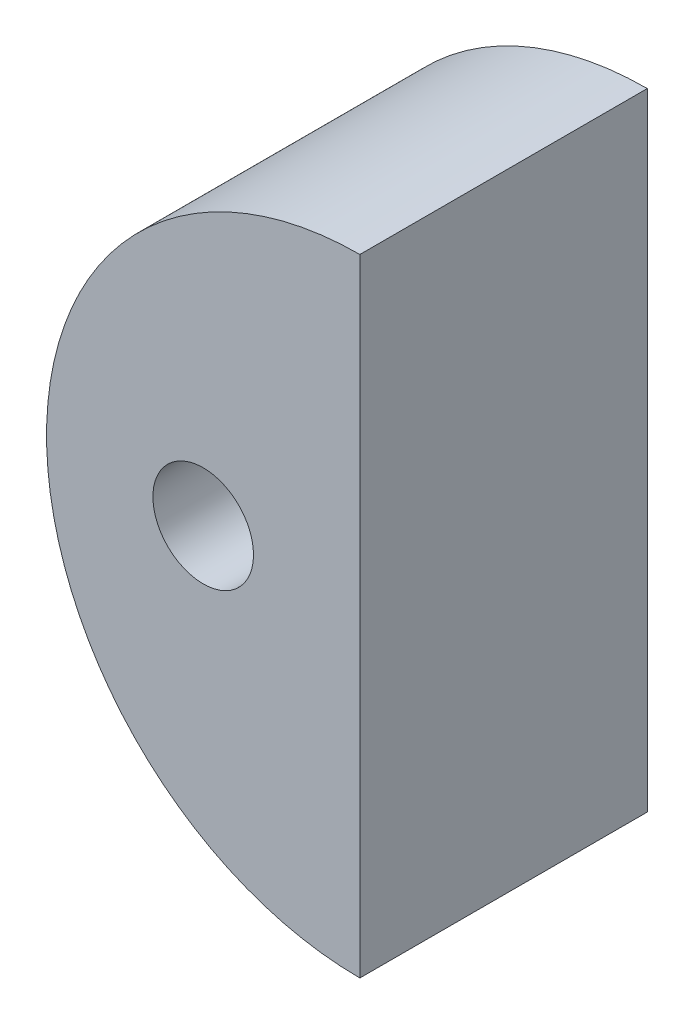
ISO-10303-21;
HEADER;
FILE_DESCRIPTION(('STEP AP214'),'2;1');
FILE_NAME('part.step','',(''),(''),'','','');
FILE_SCHEMA(('AUTOMOTIVE_DESIGN { 1 0 10303 214 1 1 1 1 }'));
ENDSEC;
DATA;
#1=APPLICATION_CONTEXT('core data for automotive mechanical design processes');
#2=APPLICATION_PROTOCOL_DEFINITION('international standard','automotive_design',2000,#1);
#3=PRODUCT_CONTEXT('',#1,'mechanical');
#4=PRODUCT('Part','Part','',(#3));
#5=PRODUCT_RELATED_PRODUCT_CATEGORY('part','',(#4));
#6=PRODUCT_DEFINITION_FORMATION('','',#4);
#7=PRODUCT_DEFINITION_CONTEXT('part definition',#1,'design');
#8=PRODUCT_DEFINITION('design','',#6,#7);
#9=PRODUCT_DEFINITION_SHAPE('','',#8);
#10=(LENGTH_UNIT() NAMED_UNIT(*) SI_UNIT(.MILLI.,.METRE.));
#11=(NAMED_UNIT(*) PLANE_ANGLE_UNIT() SI_UNIT($,.RADIAN.));
#12=(NAMED_UNIT(*) SI_UNIT($,.STERADIAN.) SOLID_ANGLE_UNIT());
#13=UNCERTAINTY_MEASURE_WITH_UNIT(LENGTH_MEASURE(1.E-05),#10,'distance_accuracy_value','');
#14=(GEOMETRIC_REPRESENTATION_CONTEXT(3) GLOBAL_UNCERTAINTY_ASSIGNED_CONTEXT((#13)) GLOBAL_UNIT_ASSIGNED_CONTEXT((#10,
#11,#12)) REPRESENTATION_CONTEXT('',''));
#15=CARTESIAN_POINT('',(0.,0.,0.));
#16=DIRECTION('',(0.,0.,1.));
#17=DIRECTION('',(1.,0.,0.));
#18=AXIS2_PLACEMENT_3D('',#15,#16,#17);
#19=CARTESIAN_POINT('',(-30.,-4.60000000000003,10.));
#20=DIRECTION('',(0.,0.,1.));
#21=DIRECTION('',(1.,0.,0.));
#22=AXIS2_PLACEMENT_3D('',#19,#20,#21);
#23=PLANE('',#22);
#24=CARTESIAN_POINT('',(-30.,-4.60000000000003,10.));
#25=DIRECTION('',(0.,0.,1.));
#26=DIRECTION('',(1.,0.,0.));
#27=AXIS2_PLACEMENT_3D('',#24,#25,#26);
#28=CIRCLE('',#27,10.9);
#29=CARTESIAN_POINT('',(-30.,6.29999999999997,10.));
#30=VERTEX_POINT('',#29);
#31=CARTESIAN_POINT('',(-30.,-15.5,10.));
#32=VERTEX_POINT('',#31);
#33=EDGE_CURVE('E70',#30,#32,#28,.T.);
#34=ORIENTED_EDGE('',*,*,#33,.T.);
#35=DIRECTION('',(0.,1.,0.));
#36=VECTOR('',#35,1.);
#37=CARTESIAN_POINT('',(-30.,6.29999999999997,10.));
#38=LINE('',#37,#36);
#39=EDGE_CURVE('E55',#32,#30,#38,.T.);
#40=ORIENTED_EDGE('',*,*,#39,.T.);
#41=EDGE_LOOP('',(#34,#40));
#42=FACE_BOUND('',#41,.T.);
#43=CARTESIAN_POINT('',(-35.45,-4.60000000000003,10.));
#44=DIRECTION('',(0.,0.,1.));
#45=DIRECTION('',(1.,0.,0.));
#46=AXIS2_PLACEMENT_3D('',#43,#44,#45);
#47=CIRCLE('',#46,1.75);
#48=CARTESIAN_POINT('',(-33.7,-4.60000000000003,10.));
#49=VERTEX_POINT('',#48);
#50=EDGE_CURVE('E76',#49,#49,#47,.T.);
#51=ORIENTED_EDGE('',*,*,#50,.F.);
#52=EDGE_LOOP('',(#51));
#53=FACE_BOUND('',#52,.T.);
#54=ADVANCED_FACE('F39',(#42,#53),#23,.T.);
#55=CARTESIAN_POINT('',(-30.,-4.60000000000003,0.));
#56=DIRECTION('',(0.,0.,1.));
#57=DIRECTION('',(1.,0.,0.));
#58=AXIS2_PLACEMENT_3D('',#55,#56,#57);
#59=PLANE('',#58);
#60=CARTESIAN_POINT('',(-30.,-4.60000000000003,0.));
#61=DIRECTION('',(0.,0.,1.));
#62=DIRECTION('',(1.,0.,0.));
#63=AXIS2_PLACEMENT_3D('',#60,#61,#62);
#64=CIRCLE('',#63,10.9);
#65=CARTESIAN_POINT('',(-30.,6.29999999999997,0.));
#66=VERTEX_POINT('',#65);
#67=CARTESIAN_POINT('',(-30.,-15.5,0.));
#68=VERTEX_POINT('',#67);
#69=EDGE_CURVE('E71',#66,#68,#64,.T.);
#70=ORIENTED_EDGE('',*,*,#69,.F.);
#71=DIRECTION('',(0.,1.,0.));
#72=VECTOR('',#71,1.);
#73=CARTESIAN_POINT('',(-30.,6.29999999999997,0.));
#74=LINE('',#73,#72);
#75=EDGE_CURVE('E63',#68,#66,#74,.T.);
#76=ORIENTED_EDGE('',*,*,#75,.F.);
#77=EDGE_LOOP('',(#70,#76));
#78=FACE_BOUND('',#77,.T.);
#79=CARTESIAN_POINT('',(-35.45,-4.60000000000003,0.));
#80=DIRECTION('',(0.,0.,1.));
#81=DIRECTION('',(1.,0.,0.));
#82=AXIS2_PLACEMENT_3D('',#79,#80,#81);
#83=CIRCLE('',#82,1.75);
#84=CARTESIAN_POINT('',(-33.7,-4.60000000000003,0.));
#85=VERTEX_POINT('',#84);
#86=EDGE_CURVE('E79',#85,#85,#83,.T.);
#87=ORIENTED_EDGE('',*,*,#86,.T.);
#88=EDGE_LOOP('',(#87));
#89=FACE_BOUND('',#88,.T.);
#90=ADVANCED_FACE('F74',(#78,#89),#59,.F.);
#91=CARTESIAN_POINT('',(-30.,-4.60000000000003,10.));
#92=DIRECTION('',(0.,0.,-1.));
#93=DIRECTION('',(-1.,0.,0.));
#94=AXIS2_PLACEMENT_3D('',#91,#92,#93);
#95=CYLINDRICAL_SURFACE('',#94,10.9);
#96=ORIENTED_EDGE('',*,*,#69,.T.);
#97=DIRECTION('',(0.,0.,-1.));
#98=VECTOR('',#97,1.);
#99=CARTESIAN_POINT('',(-30.,-15.5,10.));
#100=LINE('',#99,#98);
#101=EDGE_CURVE('E11',#32,#68,#100,.T.);
#102=ORIENTED_EDGE('',*,*,#101,.F.);
#103=ORIENTED_EDGE('',*,*,#33,.F.);
#104=DIRECTION('',(0.,0.,-1.));
#105=VECTOR('',#104,1.);
#106=CARTESIAN_POINT('',(-30.,6.29999999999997,10.));
#107=LINE('',#106,#105);
#108=EDGE_CURVE('E48',#30,#66,#107,.T.);
#109=ORIENTED_EDGE('',*,*,#108,.T.);
#110=EDGE_LOOP('',(#96,#102,#103,#109));
#111=FACE_BOUND('',#110,.T.);
#112=ADVANCED_FACE('F41',(#111),#95,.T.);
#113=CARTESIAN_POINT('',(-30.,6.29999999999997,10.));
#114=DIRECTION('',(-1.,0.,0.));
#115=DIRECTION('',(0.,-1.,0.));
#116=AXIS2_PLACEMENT_3D('',#113,#114,#115);
#117=PLANE('',#116);
#118=ORIENTED_EDGE('',*,*,#75,.T.);
#119=ORIENTED_EDGE('',*,*,#108,.F.);
#120=ORIENTED_EDGE('',*,*,#39,.F.);
#121=ORIENTED_EDGE('',*,*,#101,.T.);
#122=EDGE_LOOP('',(#118,#119,#120,#121));
#123=FACE_BOUND('',#122,.T.);
#124=ADVANCED_FACE('F66',(#123),#117,.F.);
#125=CARTESIAN_POINT('',(-35.45,-4.60000000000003,10.));
#126=DIRECTION('',(0.,0.,-1.));
#127=DIRECTION('',(-1.,0.,0.));
#128=AXIS2_PLACEMENT_3D('',#125,#126,#127);
#129=CYLINDRICAL_SURFACE('',#128,1.75);
#130=ORIENTED_EDGE('',*,*,#50,.T.);
#131=EDGE_LOOP('',(#130));
#132=FACE_BOUND('',#131,.T.);
#133=ORIENTED_EDGE('',*,*,#86,.F.);
#134=EDGE_LOOP('',(#133));
#135=FACE_BOUND('',#134,.T.);
#136=ADVANCED_FACE('F87',(#132,#135),#129,.F.);
#137=CLOSED_SHELL('',(#54,#90,#112,#124,#136));
#138=MANIFOLD_SOLID_BREP('B2',#137);
#139=ADVANCED_BREP_SHAPE_REPRESENTATION('',(#18,#138),#14);
#140=SHAPE_DEFINITION_REPRESENTATION(#9,#139);
ENDSEC;
END-ISO-10303-21;
